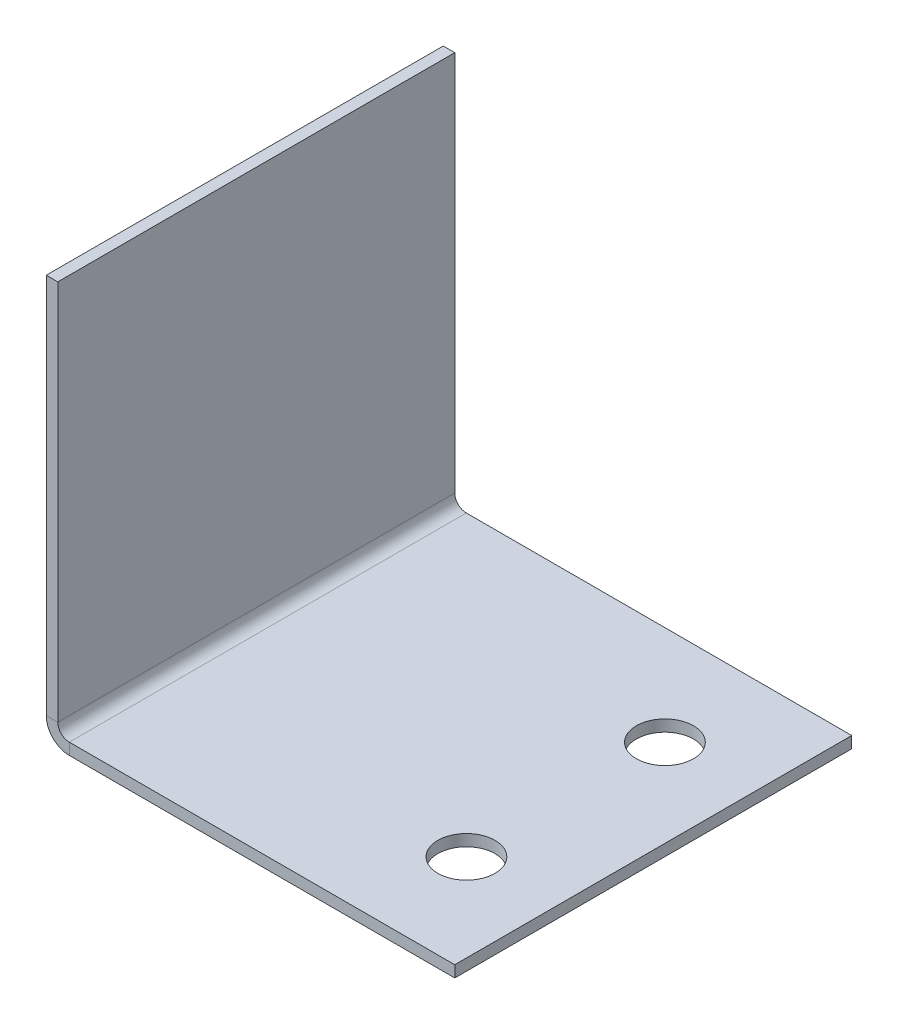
ISO-10303-21;
HEADER;
FILE_DESCRIPTION(('STEP AP214'),'2;1');
FILE_NAME('part.step','',(''),(''),'','','');
FILE_SCHEMA(('AUTOMOTIVE_DESIGN { 1 0 10303 214 1 1 1 1 }'));
ENDSEC;
DATA;
#1=APPLICATION_CONTEXT('core data for automotive mechanical design processes');
#2=APPLICATION_PROTOCOL_DEFINITION('international standard','automotive_design',2000,#1);
#3=PRODUCT_CONTEXT('',#1,'mechanical');
#4=PRODUCT('Part','Part','',(#3));
#5=PRODUCT_RELATED_PRODUCT_CATEGORY('part','',(#4));
#6=PRODUCT_DEFINITION_FORMATION('','',#4);
#7=PRODUCT_DEFINITION_CONTEXT('part definition',#1,'design');
#8=PRODUCT_DEFINITION('design','',#6,#7);
#9=PRODUCT_DEFINITION_SHAPE('','',#8);
#10=(LENGTH_UNIT() NAMED_UNIT(*) SI_UNIT(.MILLI.,.METRE.));
#11=(NAMED_UNIT(*) PLANE_ANGLE_UNIT() SI_UNIT($,.RADIAN.));
#12=(NAMED_UNIT(*) SI_UNIT($,.STERADIAN.) SOLID_ANGLE_UNIT());
#13=UNCERTAINTY_MEASURE_WITH_UNIT(LENGTH_MEASURE(1.E-05),#10,'distance_accuracy_value','');
#14=(GEOMETRIC_REPRESENTATION_CONTEXT(3) GLOBAL_UNCERTAINTY_ASSIGNED_CONTEXT((#13)) GLOBAL_UNIT_ASSIGNED_CONTEXT((#10,
#11,#12)) REPRESENTATION_CONTEXT('',''));
#15=CARTESIAN_POINT('',(0.,0.,0.));
#16=DIRECTION('',(0.,0.,1.));
#17=DIRECTION('',(1.,0.,0.));
#18=AXIS2_PLACEMENT_3D('',#15,#16,#17);
#19=CARTESIAN_POINT('',(-0.736599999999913,25.1376271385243,12.7));
#20=DIRECTION('',(0.,0.,1.));
#21=DIRECTION('',(0.,-1.,0.));
#22=AXIS2_PLACEMENT_3D('',#19,#20,#21);
#23=PLANE('',#22);
#24=DIRECTION('',(0.,-1.,0.));
#25=VECTOR('',#24,1.);
#26=CARTESIAN_POINT('',(-0.736599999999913,25.1376271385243,12.7));
#27=LINE('',#26,#25);
#28=CARTESIAN_POINT('',(-0.736599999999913,25.1376271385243,12.7));
#29=VERTEX_POINT('',#28);
#30=CARTESIAN_POINT('',(-0.736599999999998,0.736600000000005,12.7));
#31=VERTEX_POINT('',#30);
#32=EDGE_CURVE('E116',#29,#31,#27,.T.);
#33=ORIENTED_EDGE('',*,*,#32,.T.);
#34=DIRECTION('',(1.,0.,0.));
#35=VECTOR('',#34,1.);
#36=CARTESIAN_POINT('',(-0.736599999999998,0.736600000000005,12.7));
#37=LINE('',#36,#35);
#38=CARTESIAN_POINT('',(0.,0.736600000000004,12.7));
#39=VERTEX_POINT('',#38);
#40=EDGE_CURVE('E14',#31,#39,#37,.T.);
#41=ORIENTED_EDGE('',*,*,#40,.T.);
#42=DIRECTION('',(0.,-1.,0.));
#43=VECTOR('',#42,1.);
#44=CARTESIAN_POINT('',(0.,25.1376271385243,12.7));
#45=LINE('',#44,#43);
#46=CARTESIAN_POINT('',(0.,25.1376271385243,12.7));
#47=VERTEX_POINT('',#46);
#48=EDGE_CURVE('E109',#47,#39,#45,.T.);
#49=ORIENTED_EDGE('',*,*,#48,.F.);
#50=DIRECTION('',(1.,0.,0.));
#51=VECTOR('',#50,1.);
#52=CARTESIAN_POINT('',(-0.736599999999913,25.1376271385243,12.7));
#53=LINE('',#52,#51);
#54=EDGE_CURVE('E82',#29,#47,#53,.T.);
#55=ORIENTED_EDGE('',*,*,#54,.F.);
#56=EDGE_LOOP('',(#33,#41,#49,#55));
#57=FACE_BOUND('',#56,.T.);
#58=ADVANCED_FACE('F57',(#57),#23,.T.);
#59=CARTESIAN_POINT('',(-0.736599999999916,25.1376271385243,-12.7));
#60=DIRECTION('',(0.,0.,-1.));
#61=DIRECTION('',(0.,1.,0.));
#62=AXIS2_PLACEMENT_3D('',#59,#60,#61);
#63=PLANE('',#62);
#64=DIRECTION('',(0.,1.,0.));
#65=VECTOR('',#64,1.);
#66=CARTESIAN_POINT('',(0.,25.1376271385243,-12.7));
#67=LINE('',#66,#65);
#68=CARTESIAN_POINT('',(0.,0.736600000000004,-12.7));
#69=VERTEX_POINT('',#68);
#70=CARTESIAN_POINT('',(0.,25.1376271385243,-12.7));
#71=VERTEX_POINT('',#70);
#72=EDGE_CURVE('E111',#69,#71,#67,.T.);
#73=ORIENTED_EDGE('',*,*,#72,.F.);
#74=DIRECTION('',(-1.,0.,0.));
#75=VECTOR('',#74,1.);
#76=CARTESIAN_POINT('',(-0.736600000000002,0.736600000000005,-12.7));
#77=LINE('',#76,#75);
#78=CARTESIAN_POINT('',(-0.736600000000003,0.736600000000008,-12.7));
#79=VERTEX_POINT('',#78);
#80=EDGE_CURVE('E165',#69,#79,#77,.T.);
#81=ORIENTED_EDGE('',*,*,#80,.T.);
#82=DIRECTION('',(0.,1.,0.));
#83=VECTOR('',#82,1.);
#84=CARTESIAN_POINT('',(-0.736599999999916,25.1376271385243,-12.7));
#85=LINE('',#84,#83);
#86=CARTESIAN_POINT('',(-0.736599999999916,25.1376271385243,-12.7));
#87=VERTEX_POINT('',#86);
#88=EDGE_CURVE('E60',#79,#87,#85,.T.);
#89=ORIENTED_EDGE('',*,*,#88,.T.);
#90=DIRECTION('',(1.,0.,0.));
#91=VECTOR('',#90,1.);
#92=CARTESIAN_POINT('',(-0.736599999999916,25.1376271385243,-12.7));
#93=LINE('',#92,#91);
#94=EDGE_CURVE('E102',#87,#71,#93,.T.);
#95=ORIENTED_EDGE('',*,*,#94,.T.);
#96=EDGE_LOOP('',(#73,#81,#89,#95));
#97=FACE_BOUND('',#96,.T.);
#98=ADVANCED_FACE('F234',(#97),#63,.T.);
#99=CARTESIAN_POINT('',(-0.736600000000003,-0.26237286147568,0.));
#100=DIRECTION('',(-1.,0.,0.));
#101=DIRECTION('',(0.,0.,-1.));
#102=AXIS2_PLACEMENT_3D('',#99,#100,#101);
#103=PLANE('',#102);
#104=ORIENTED_EDGE('',*,*,#88,.F.);
#105=DIRECTION('',(0.,0.,1.));
#106=VECTOR('',#105,1.);
#107=CARTESIAN_POINT('',(-0.7366,0.736600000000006,0.));
#108=LINE('',#107,#106);
#109=EDGE_CURVE('E101',#79,#31,#108,.T.);
#110=ORIENTED_EDGE('',*,*,#109,.T.);
#111=ORIENTED_EDGE('',*,*,#32,.F.);
#112=DIRECTION('',(0.,0.,1.));
#113=VECTOR('',#112,1.);
#114=CARTESIAN_POINT('',(-0.736599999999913,25.1376271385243,12.7));
#115=LINE('',#114,#113);
#116=EDGE_CURVE('E99',#87,#29,#115,.T.);
#117=ORIENTED_EDGE('',*,*,#116,.F.);
#118=EDGE_LOOP('',(#104,#110,#111,#117));
#119=FACE_BOUND('',#118,.T.);
#120=ADVANCED_FACE('F232',(#119),#103,.T.);
#121=CARTESIAN_POINT('',(-0.736599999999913,25.1376271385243,12.7));
#122=DIRECTION('',(0.,1.,0.));
#123=DIRECTION('',(0.,0.,1.));
#124=AXIS2_PLACEMENT_3D('',#121,#122,#123);
#125=PLANE('',#124);
#126=DIRECTION('',(0.,0.,1.));
#127=VECTOR('',#126,1.);
#128=CARTESIAN_POINT('',(0.,25.1376271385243,12.7));
#129=LINE('',#128,#127);
#130=EDGE_CURVE('E97',#71,#47,#129,.T.);
#131=ORIENTED_EDGE('',*,*,#130,.F.);
#132=ORIENTED_EDGE('',*,*,#94,.F.);
#133=ORIENTED_EDGE('',*,*,#116,.T.);
#134=ORIENTED_EDGE('',*,*,#54,.T.);
#135=EDGE_LOOP('',(#131,#132,#133,#134));
#136=FACE_BOUND('',#135,.T.);
#137=ADVANCED_FACE('F95',(#136),#125,.T.);
#138=CARTESIAN_POINT('',(0.,-0.262372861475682,0.));
#139=DIRECTION('',(-1.,0.,0.));
#140=DIRECTION('',(0.,0.,-1.));
#141=AXIS2_PLACEMENT_3D('',#138,#139,#140);
#142=PLANE('',#141);
#143=DIRECTION('',(0.,0.,1.));
#144=VECTOR('',#143,1.);
#145=CARTESIAN_POINT('',(0.,0.736600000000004,0.));
#146=LINE('',#145,#144);
#147=EDGE_CURVE('E65',#69,#39,#146,.T.);
#148=ORIENTED_EDGE('',*,*,#147,.F.);
#149=ORIENTED_EDGE('',*,*,#72,.T.);
#150=ORIENTED_EDGE('',*,*,#130,.T.);
#151=ORIENTED_EDGE('',*,*,#48,.T.);
#152=EDGE_LOOP('',(#148,#149,#150,#151));
#153=FACE_BOUND('',#152,.T.);
#154=ADVANCED_FACE('F107',(#153),#142,.F.);
#155=CARTESIAN_POINT('',(25.4,-0.7366,12.7));
#156=DIRECTION('',(1.,0.,0.));
#157=DIRECTION('',(0.,0.,-1.));
#158=AXIS2_PLACEMENT_3D('',#155,#156,#157);
#159=PLANE('',#158);
#160=DIRECTION('',(0.,0.,-1.));
#161=VECTOR('',#160,1.);
#162=CARTESIAN_POINT('',(25.4,0.,12.7));
#163=LINE('',#162,#161);
#164=CARTESIAN_POINT('',(25.4,0.,12.7));
#165=VERTEX_POINT('',#164);
#166=CARTESIAN_POINT('',(25.4,0.,-12.7));
#167=VERTEX_POINT('',#166);
#168=EDGE_CURVE('E127',#165,#167,#163,.T.);
#169=ORIENTED_EDGE('',*,*,#168,.F.);
#170=DIRECTION('',(0.,1.,0.));
#171=VECTOR('',#170,1.);
#172=CARTESIAN_POINT('',(25.4,-0.7366,12.7));
#173=LINE('',#172,#171);
#174=CARTESIAN_POINT('',(25.4,-0.7366,12.7));
#175=VERTEX_POINT('',#174);
#176=EDGE_CURVE('E117',#175,#165,#173,.T.);
#177=ORIENTED_EDGE('',*,*,#176,.F.);
#178=DIRECTION('',(0.,0.,-1.));
#179=VECTOR('',#178,1.);
#180=CARTESIAN_POINT('',(25.4,-0.7366,12.7));
#181=LINE('',#180,#179);
#182=CARTESIAN_POINT('',(25.4,-0.7366,-12.7));
#183=VERTEX_POINT('',#182);
#184=EDGE_CURVE('E150',#175,#183,#181,.T.);
#185=ORIENTED_EDGE('',*,*,#184,.T.);
#186=DIRECTION('',(0.,1.,0.));
#187=VECTOR('',#186,1.);
#188=CARTESIAN_POINT('',(25.4,-0.7366,-12.7));
#189=LINE('',#188,#187);
#190=EDGE_CURVE('E147',#183,#167,#189,.T.);
#191=ORIENTED_EDGE('',*,*,#190,.T.);
#192=EDGE_LOOP('',(#169,#177,#185,#191));
#193=FACE_BOUND('',#192,.T.);
#194=ADVANCED_FACE('F263',(#193),#159,.T.);
#195=CARTESIAN_POINT('',(0.,-0.7366,0.));
#196=DIRECTION('',(0.,-1.,0.));
#197=DIRECTION('',(0.,0.,-1.));
#198=AXIS2_PLACEMENT_3D('',#195,#196,#197);
#199=PLANE('',#198);
#200=CARTESIAN_POINT('',(19.7963414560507,-0.7366,6.35));
#201=DIRECTION('',(0.,-1.,0.));
#202=DIRECTION('',(0.,0.,-1.));
#203=AXIS2_PLACEMENT_3D('',#200,#201,#202);
#204=CIRCLE('',#203,1.8288);
#205=CARTESIAN_POINT('',(19.7963414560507,-0.7366,4.5212));
#206=VERTEX_POINT('',#205);
#207=EDGE_CURVE('E197',#206,#206,#204,.T.);
#208=ORIENTED_EDGE('',*,*,#207,.F.);
#209=EDGE_LOOP('',(#208));
#210=FACE_BOUND('',#209,.T.);
#211=CARTESIAN_POINT('',(19.7963414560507,-0.7366,-6.35));
#212=DIRECTION('',(0.,-1.,0.));
#213=DIRECTION('',(0.,0.,-1.));
#214=AXIS2_PLACEMENT_3D('',#211,#212,#213);
#215=CIRCLE('',#214,1.8288);
#216=CARTESIAN_POINT('',(19.7963414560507,-0.7366,-8.1788));
#217=VERTEX_POINT('',#216);
#218=EDGE_CURVE('E186',#217,#217,#215,.T.);
#219=ORIENTED_EDGE('',*,*,#218,.F.);
#220=EDGE_LOOP('',(#219));
#221=FACE_BOUND('',#220,.T.);
#222=DIRECTION('',(0.,0.,1.));
#223=VECTOR('',#222,1.);
#224=CARTESIAN_POINT('',(0.736599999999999,-0.7366,0.));
#225=LINE('',#224,#223);
#226=CARTESIAN_POINT('',(0.7366,-0.7366,-12.7));
#227=VERTEX_POINT('',#226);
#228=CARTESIAN_POINT('',(0.7366,-0.7366,12.7));
#229=VERTEX_POINT('',#228);
#230=EDGE_CURVE('E159',#227,#229,#225,.T.);
#231=ORIENTED_EDGE('',*,*,#230,.F.);
#232=DIRECTION('',(-1.,0.,0.));
#233=VECTOR('',#232,1.);
#234=CARTESIAN_POINT('',(-25.4,-0.7366,-12.7));
#235=LINE('',#234,#233);
#236=EDGE_CURVE('E144',#183,#227,#235,.T.);
#237=ORIENTED_EDGE('',*,*,#236,.F.);
#238=ORIENTED_EDGE('',*,*,#184,.F.);
#239=DIRECTION('',(1.,0.,0.));
#240=VECTOR('',#239,1.);
#241=CARTESIAN_POINT('',(-25.4,-0.7366,12.7));
#242=LINE('',#241,#240);
#243=EDGE_CURVE('E119',#229,#175,#242,.T.);
#244=ORIENTED_EDGE('',*,*,#243,.F.);
#245=EDGE_LOOP('',(#231,#237,#238,#244));
#246=FACE_BOUND('',#245,.T.);
#247=ADVANCED_FACE('F245',(#210,#221,#246),#199,.T.);
#248=CARTESIAN_POINT('',(-25.4,-0.7366,-12.7));
#249=DIRECTION('',(0.,0.,-1.));
#250=DIRECTION('',(-1.,0.,0.));
#251=AXIS2_PLACEMENT_3D('',#248,#249,#250);
#252=PLANE('',#251);
#253=DIRECTION('',(0.,-1.,0.));
#254=VECTOR('',#253,1.);
#255=CARTESIAN_POINT('',(0.736599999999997,-0.7366,-12.7));
#256=LINE('',#255,#254);
#257=CARTESIAN_POINT('',(0.7366,0.,-12.7));
#258=VERTEX_POINT('',#257);
#259=EDGE_CURVE('E153',#258,#227,#256,.T.);
#260=ORIENTED_EDGE('',*,*,#259,.F.);
#261=DIRECTION('',(-1.,0.,0.));
#262=VECTOR('',#261,1.);
#263=CARTESIAN_POINT('',(-25.4,0.,-12.7));
#264=LINE('',#263,#262);
#265=EDGE_CURVE('E141',#167,#258,#264,.T.);
#266=ORIENTED_EDGE('',*,*,#265,.F.);
#267=ORIENTED_EDGE('',*,*,#190,.F.);
#268=ORIENTED_EDGE('',*,*,#236,.T.);
#269=EDGE_LOOP('',(#260,#266,#267,#268));
#270=FACE_BOUND('',#269,.T.);
#271=ADVANCED_FACE('F210',(#270),#252,.T.);
#272=CARTESIAN_POINT('',(0.,0.,0.));
#273=DIRECTION('',(0.,-1.,0.));
#274=DIRECTION('',(0.,0.,-1.));
#275=AXIS2_PLACEMENT_3D('',#272,#273,#274);
#276=PLANE('',#275);
#277=CARTESIAN_POINT('',(19.7963414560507,0.,6.35));
#278=DIRECTION('',(0.,1.,0.));
#279=DIRECTION('',(0.,0.,1.));
#280=AXIS2_PLACEMENT_3D('',#277,#278,#279);
#281=CIRCLE('',#280,1.8288);
#282=CARTESIAN_POINT('',(19.7963414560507,0.,8.1788));
#283=VERTEX_POINT('',#282);
#284=EDGE_CURVE('E200',#283,#283,#281,.T.);
#285=ORIENTED_EDGE('',*,*,#284,.F.);
#286=EDGE_LOOP('',(#285));
#287=FACE_BOUND('',#286,.T.);
#288=CARTESIAN_POINT('',(19.7963414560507,0.,-6.35));
#289=DIRECTION('',(0.,1.,0.));
#290=DIRECTION('',(0.,0.,1.));
#291=AXIS2_PLACEMENT_3D('',#288,#289,#290);
#292=CIRCLE('',#291,1.8288);
#293=CARTESIAN_POINT('',(19.7963414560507,0.,-4.5212));
#294=VERTEX_POINT('',#293);
#295=EDGE_CURVE('E191',#294,#294,#292,.T.);
#296=ORIENTED_EDGE('',*,*,#295,.F.);
#297=EDGE_LOOP('',(#296));
#298=FACE_BOUND('',#297,.T.);
#299=ORIENTED_EDGE('',*,*,#265,.T.);
#300=DIRECTION('',(0.,0.,1.));
#301=VECTOR('',#300,1.);
#302=CARTESIAN_POINT('',(0.736599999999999,0.,0.));
#303=LINE('',#302,#301);
#304=CARTESIAN_POINT('',(0.7366,0.,12.7));
#305=VERTEX_POINT('',#304);
#306=EDGE_CURVE('E138',#258,#305,#303,.T.);
#307=ORIENTED_EDGE('',*,*,#306,.T.);
#308=DIRECTION('',(1.,0.,0.));
#309=VECTOR('',#308,1.);
#310=CARTESIAN_POINT('',(-25.4,0.,12.7));
#311=LINE('',#310,#309);
#312=EDGE_CURVE('E135',#305,#165,#311,.T.);
#313=ORIENTED_EDGE('',*,*,#312,.T.);
#314=ORIENTED_EDGE('',*,*,#168,.T.);
#315=EDGE_LOOP('',(#299,#307,#313,#314));
#316=FACE_BOUND('',#315,.T.);
#317=ADVANCED_FACE('F206',(#287,#298,#316),#276,.F.);
#318=CARTESIAN_POINT('',(-25.4,-0.7366,12.7));
#319=DIRECTION('',(0.,0.,1.));
#320=DIRECTION('',(1.,0.,0.));
#321=AXIS2_PLACEMENT_3D('',#318,#319,#320);
#322=PLANE('',#321);
#323=DIRECTION('',(0.,1.,0.));
#324=VECTOR('',#323,1.);
#325=CARTESIAN_POINT('',(0.7366,-0.7366,12.7));
#326=LINE('',#325,#324);
#327=EDGE_CURVE('E156',#229,#305,#326,.T.);
#328=ORIENTED_EDGE('',*,*,#327,.F.);
#329=ORIENTED_EDGE('',*,*,#243,.T.);
#330=ORIENTED_EDGE('',*,*,#176,.T.);
#331=ORIENTED_EDGE('',*,*,#312,.F.);
#332=EDGE_LOOP('',(#328,#329,#330,#331));
#333=FACE_BOUND('',#332,.T.);
#334=ADVANCED_FACE('F209',(#333),#322,.T.);
#335=CARTESIAN_POINT('',(0.736599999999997,0.7366,-12.7));
#336=DIRECTION('',(0.,0.,-1.));
#337=DIRECTION('',(-1.,0.,0.));
#338=AXIS2_PLACEMENT_3D('',#335,#336,#337);
#339=PLANE('',#338);
#340=ORIENTED_EDGE('',*,*,#80,.F.);
#341=CARTESIAN_POINT('',(0.736599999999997,0.7366,-12.7));
#342=DIRECTION('',(0.,0.,-1.));
#343=DIRECTION('',(-1.,0.,0.));
#344=AXIS2_PLACEMENT_3D('',#341,#342,#343);
#345=CIRCLE('',#344,0.7366);
#346=EDGE_CURVE('E178',#69,#258,#345,.F.);
#347=ORIENTED_EDGE('',*,*,#346,.T.);
#348=ORIENTED_EDGE('',*,*,#259,.T.);
#349=CARTESIAN_POINT('',(0.736599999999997,0.7366,-12.7));
#350=DIRECTION('',(0.,0.,1.));
#351=DIRECTION('',(-1.,0.,0.));
#352=AXIS2_PLACEMENT_3D('',#349,#350,#351);
#353=CIRCLE('',#352,1.4732);
#354=EDGE_CURVE('E183',#79,#227,#353,.T.);
#355=ORIENTED_EDGE('',*,*,#354,.F.);
#356=EDGE_LOOP('',(#340,#347,#348,#355));
#357=FACE_BOUND('',#356,.T.);
#358=ADVANCED_FACE('F224',(#357),#339,.T.);
#359=CARTESIAN_POINT('',(0.736600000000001,0.7366,12.7));
#360=DIRECTION('',(0.,0.,1.));
#361=DIRECTION('',(1.,0.,0.));
#362=AXIS2_PLACEMENT_3D('',#359,#360,#361);
#363=PLANE('',#362);
#364=CARTESIAN_POINT('',(0.736600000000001,0.7366,12.7));
#365=DIRECTION('',(0.,0.,-1.));
#366=DIRECTION('',(-1.,0.,0.));
#367=AXIS2_PLACEMENT_3D('',#364,#365,#366);
#368=CIRCLE('',#367,0.7366);
#369=EDGE_CURVE('E130',#305,#39,#368,.T.);
#370=ORIENTED_EDGE('',*,*,#369,.T.);
#371=ORIENTED_EDGE('',*,*,#40,.F.);
#372=CARTESIAN_POINT('',(0.736600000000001,0.7366,12.7));
#373=DIRECTION('',(0.,0.,-1.));
#374=DIRECTION('',(1.,0.,0.));
#375=AXIS2_PLACEMENT_3D('',#372,#373,#374);
#376=CIRCLE('',#375,1.4732);
#377=EDGE_CURVE('E73',#229,#31,#376,.T.);
#378=ORIENTED_EDGE('',*,*,#377,.F.);
#379=ORIENTED_EDGE('',*,*,#327,.T.);
#380=EDGE_LOOP('',(#370,#371,#378,#379));
#381=FACE_BOUND('',#380,.T.);
#382=ADVANCED_FACE('F181',(#381),#363,.T.);
#383=CARTESIAN_POINT('',(0.736600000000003,0.7366,25.4698801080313));
#384=DIRECTION('',(0.,0.,-1.));
#385=DIRECTION('',(-1.,0.,0.));
#386=AXIS2_PLACEMENT_3D('',#383,#384,#385);
#387=CYLINDRICAL_SURFACE('',#386,1.4732);
#388=ORIENTED_EDGE('',*,*,#230,.T.);
#389=ORIENTED_EDGE('',*,*,#377,.T.);
#390=ORIENTED_EDGE('',*,*,#109,.F.);
#391=ORIENTED_EDGE('',*,*,#354,.T.);
#392=EDGE_LOOP('',(#388,#389,#390,#391));
#393=FACE_BOUND('',#392,.T.);
#394=ADVANCED_FACE('F229',(#393),#387,.T.);
#395=CARTESIAN_POINT('',(0.736600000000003,0.7366,25.4698801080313));
#396=DIRECTION('',(0.,0.,-1.));
#397=DIRECTION('',(-1.,0.,0.));
#398=AXIS2_PLACEMENT_3D('',#395,#396,#397);
#399=CYLINDRICAL_SURFACE('',#398,0.7366);
#400=ORIENTED_EDGE('',*,*,#306,.F.);
#401=ORIENTED_EDGE('',*,*,#346,.F.);
#402=ORIENTED_EDGE('',*,*,#147,.T.);
#403=ORIENTED_EDGE('',*,*,#369,.F.);
#404=EDGE_LOOP('',(#400,#401,#402,#403));
#405=FACE_BOUND('',#404,.T.);
#406=ADVANCED_FACE('F174',(#405),#399,.F.);
#407=CARTESIAN_POINT('',(19.7963414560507,-5.08,-6.35));
#408=DIRECTION('',(0.,1.,0.));
#409=DIRECTION('',(0.,0.,1.));
#410=AXIS2_PLACEMENT_3D('',#407,#408,#409);
#411=CYLINDRICAL_SURFACE('',#410,1.8288);
#412=ORIENTED_EDGE('',*,*,#218,.T.);
#413=EDGE_LOOP('',(#412));
#414=FACE_BOUND('',#413,.T.);
#415=ORIENTED_EDGE('',*,*,#295,.T.);
#416=EDGE_LOOP('',(#415));
#417=FACE_BOUND('',#416,.T.);
#418=ADVANCED_FACE('F360',(#414,#417),#411,.F.);
#419=CARTESIAN_POINT('',(19.7963414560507,-5.08,6.35));
#420=DIRECTION('',(0.,1.,0.));
#421=DIRECTION('',(0.,0.,1.));
#422=AXIS2_PLACEMENT_3D('',#419,#420,#421);
#423=CYLINDRICAL_SURFACE('',#422,1.8288);
#424=ORIENTED_EDGE('',*,*,#207,.T.);
#425=EDGE_LOOP('',(#424));
#426=FACE_BOUND('',#425,.T.);
#427=ORIENTED_EDGE('',*,*,#284,.T.);
#428=EDGE_LOOP('',(#427));
#429=FACE_BOUND('',#428,.T.);
#430=ADVANCED_FACE('F204',(#426,#429),#423,.F.);
#431=CLOSED_SHELL('',(#58,#98,#120,#137,#154,#194,#247,#271,#317,#334,#358,#382,#394,#406,#418,#430));
#432=MANIFOLD_SOLID_BREP('B2',#431);
#433=ADVANCED_BREP_SHAPE_REPRESENTATION('',(#18,#432),#14);
#434=SHAPE_DEFINITION_REPRESENTATION(#9,#433);
ENDSEC;
END-ISO-10303-21;
